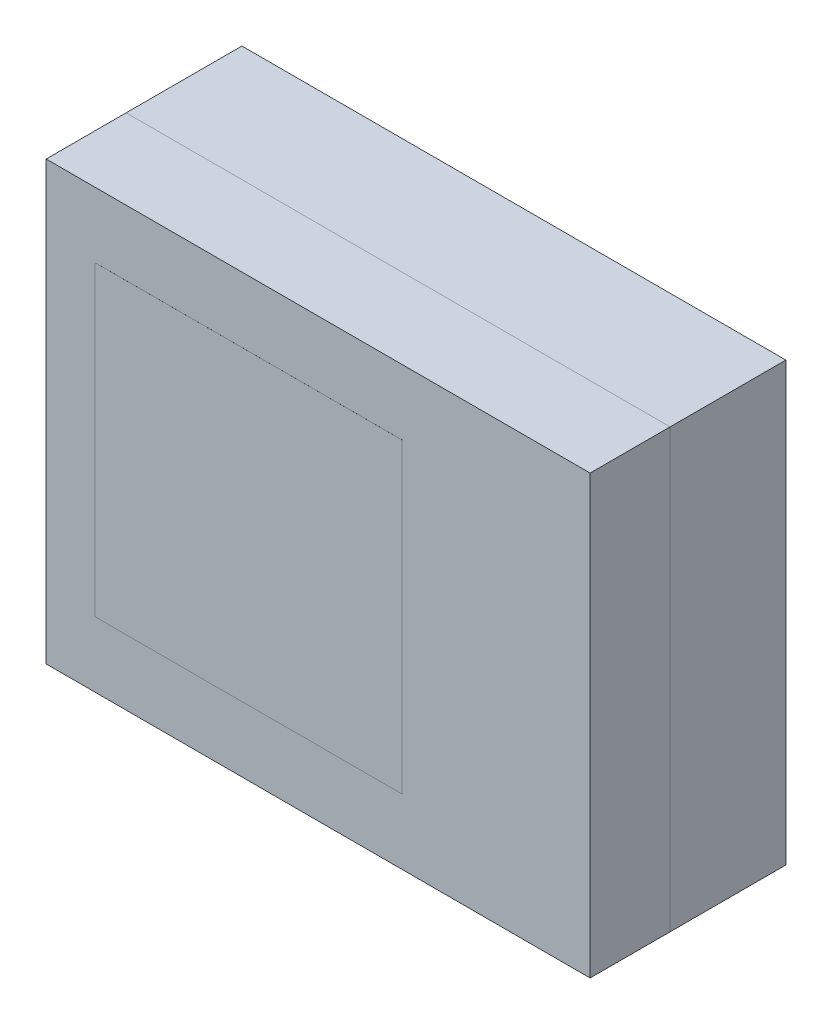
ISO-10303-21;
HEADER;
FILE_DESCRIPTION(('STEP AP214'),'2;1');
FILE_NAME('part.step','',(''),(''),'','','');
FILE_SCHEMA(('AUTOMOTIVE_DESIGN { 1 0 10303 214 1 1 1 1 }'));
ENDSEC;
DATA;
#1=APPLICATION_CONTEXT('core data for automotive mechanical design processes');
#2=APPLICATION_PROTOCOL_DEFINITION('international standard','automotive_design',2000,#1);
#3=PRODUCT_CONTEXT('',#1,'mechanical');
#4=PRODUCT('Part','Part','',(#3));
#5=PRODUCT_RELATED_PRODUCT_CATEGORY('part','',(#4));
#6=PRODUCT_DEFINITION_FORMATION('','',#4);
#7=PRODUCT_DEFINITION_CONTEXT('part definition',#1,'design');
#8=PRODUCT_DEFINITION('design','',#6,#7);
#9=PRODUCT_DEFINITION_SHAPE('','',#8);
#10=(LENGTH_UNIT() NAMED_UNIT(*) SI_UNIT(.MILLI.,.METRE.));
#11=(NAMED_UNIT(*) PLANE_ANGLE_UNIT() SI_UNIT($,.RADIAN.));
#12=(NAMED_UNIT(*) SI_UNIT($,.STERADIAN.) SOLID_ANGLE_UNIT());
#13=UNCERTAINTY_MEASURE_WITH_UNIT(LENGTH_MEASURE(1.E-05),#10,'distance_accuracy_value','');
#14=(GEOMETRIC_REPRESENTATION_CONTEXT(3) GLOBAL_UNCERTAINTY_ASSIGNED_CONTEXT((#13)) GLOBAL_UNIT_ASSIGNED_CONTEXT((#10,
#11,#12)) REPRESENTATION_CONTEXT('',''));
#15=CARTESIAN_POINT('',(0.,0.,0.));
#16=DIRECTION('',(0.,0.,1.));
#17=DIRECTION('',(1.,0.,0.));
#18=AXIS2_PLACEMENT_3D('',#15,#16,#17);
#19=CARTESIAN_POINT('',(0.,0.,-0.734));
#20=DIRECTION('',(0.,0.,-1.));
#21=DIRECTION('',(-1.,0.,0.));
#22=AXIS2_PLACEMENT_3D('',#19,#20,#21);
#23=PLANE('',#22);
#24=DIRECTION('',(0.,-1.,0.));
#25=VECTOR('',#24,1.);
#26=CARTESIAN_POINT('',(0.261,-0.125,-0.734));
#27=LINE('',#26,#25);
#28=CARTESIAN_POINT('',(0.261,-0.125,-0.734));
#29=VERTEX_POINT('',#28);
#30=CARTESIAN_POINT('',(0.261,-0.67,-0.734));
#31=VERTEX_POINT('',#30);
#32=EDGE_CURVE('E231',#29,#31,#27,.T.);
#33=ORIENTED_EDGE('',*,*,#32,.T.);
#34=DIRECTION('',(1.,0.,0.));
#35=VECTOR('',#34,1.);
#36=CARTESIAN_POINT('',(0.261,-0.67,-0.734));
#37=LINE('',#36,#35);
#38=CARTESIAN_POINT('',(1.131,-0.67,-0.734));
#39=VERTEX_POINT('',#38);
#40=EDGE_CURVE('E228',#31,#39,#37,.T.);
#41=ORIENTED_EDGE('',*,*,#40,.T.);
#42=DIRECTION('',(0.,-1.,0.));
#43=VECTOR('',#42,1.);
#44=CARTESIAN_POINT('',(1.131,-0.125,-0.734));
#45=LINE('',#44,#43);
#46=CARTESIAN_POINT('',(1.131,-0.125,-0.734));
#47=VERTEX_POINT('',#46);
#48=EDGE_CURVE('E223',#47,#39,#45,.T.);
#49=ORIENTED_EDGE('',*,*,#48,.F.);
#50=DIRECTION('',(1.,0.,0.));
#51=VECTOR('',#50,1.);
#52=CARTESIAN_POINT('',(0.261,-0.125,-0.734));
#53=LINE('',#52,#51);
#54=EDGE_CURVE('E219',#29,#47,#53,.T.);
#55=ORIENTED_EDGE('',*,*,#54,.F.);
#56=EDGE_LOOP('',(#33,#41,#49,#55));
#57=FACE_BOUND('',#56,.T.);
#58=DIRECTION('',(1.,0.,0.));
#59=VECTOR('',#58,1.);
#60=CARTESIAN_POINT('',(-0.609,-0.67,-0.734));
#61=LINE('',#60,#59);
#62=CARTESIAN_POINT('',(-0.609,-0.67,-0.734));
#63=VERTEX_POINT('',#62);
#64=CARTESIAN_POINT('',(-0.00900000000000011,-0.67,-0.734));
#65=VERTEX_POINT('',#64);
#66=EDGE_CURVE('E234',#63,#65,#61,.T.);
#67=ORIENTED_EDGE('',*,*,#66,.T.);
#68=DIRECTION('',(0.,1.,0.));
#69=VECTOR('',#68,1.);
#70=CARTESIAN_POINT('',(-0.00900000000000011,-0.67,-0.734));
#71=LINE('',#70,#69);
#72=CARTESIAN_POINT('',(-0.00900000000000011,0.67,-0.734));
#73=VERTEX_POINT('',#72);
#74=EDGE_CURVE('E265',#65,#73,#71,.T.);
#75=ORIENTED_EDGE('',*,*,#74,.T.);
#76=DIRECTION('',(1.,0.,0.));
#77=VECTOR('',#76,1.);
#78=CARTESIAN_POINT('',(-0.609,0.67,-0.734));
#79=LINE('',#78,#77);
#80=CARTESIAN_POINT('',(-0.609,0.67,-0.734));
#81=VERTEX_POINT('',#80);
#82=EDGE_CURVE('E268',#81,#73,#79,.T.);
#83=ORIENTED_EDGE('',*,*,#82,.F.);
#84=DIRECTION('',(0.,1.,0.));
#85=VECTOR('',#84,1.);
#86=CARTESIAN_POINT('',(-0.609,-0.67,-0.734));
#87=LINE('',#86,#85);
#88=EDGE_CURVE('E252',#63,#81,#87,.T.);
#89=ORIENTED_EDGE('',*,*,#88,.F.);
#90=EDGE_LOOP('',(#67,#75,#83,#89));
#91=FACE_BOUND('',#90,.T.);
#92=DIRECTION('',(0.,-1.,0.));
#93=VECTOR('',#92,1.);
#94=CARTESIAN_POINT('',(1.281,-0.82,-0.734));
#95=LINE('',#94,#93);
#96=CARTESIAN_POINT('',(1.281,0.82,-0.734));
#97=VERTEX_POINT('',#96);
#98=CARTESIAN_POINT('',(1.281,-0.82,-0.734));
#99=VERTEX_POINT('',#98);
#100=EDGE_CURVE('E291',#97,#99,#95,.T.);
#101=ORIENTED_EDGE('',*,*,#100,.T.);
#102=DIRECTION('',(-1.,0.,0.));
#103=VECTOR('',#102,1.);
#104=CARTESIAN_POINT('',(-0.759,-0.82,-0.734));
#105=LINE('',#104,#103);
#106=CARTESIAN_POINT('',(-0.759,-0.82,-0.734));
#107=VERTEX_POINT('',#106);
#108=EDGE_CURVE('E295',#99,#107,#105,.T.);
#109=ORIENTED_EDGE('',*,*,#108,.T.);
#110=DIRECTION('',(0.,1.,0.));
#111=VECTOR('',#110,1.);
#112=CARTESIAN_POINT('',(-0.759,-0.82,-0.734));
#113=LINE('',#112,#111);
#114=CARTESIAN_POINT('',(-0.759,0.82,-0.734));
#115=VERTEX_POINT('',#114);
#116=EDGE_CURVE('E299',#107,#115,#113,.T.);
#117=ORIENTED_EDGE('',*,*,#116,.T.);
#118=DIRECTION('',(1.,0.,0.));
#119=VECTOR('',#118,1.);
#120=CARTESIAN_POINT('',(-0.759,0.82,-0.734));
#121=LINE('',#120,#119);
#122=EDGE_CURVE('E302',#115,#97,#121,.T.);
#123=ORIENTED_EDGE('',*,*,#122,.T.);
#124=EDGE_LOOP('',(#101,#109,#117,#123));
#125=FACE_BOUND('',#124,.T.);
#126=DIRECTION('',(1.,0.,0.));
#127=VECTOR('',#126,1.);
#128=CARTESIAN_POINT('',(0.261,0.67,-0.734));
#129=LINE('',#128,#127);
#130=CARTESIAN_POINT('',(0.261,0.67,-0.734));
#131=VERTEX_POINT('',#130);
#132=CARTESIAN_POINT('',(1.131,0.67,-0.734));
#133=VERTEX_POINT('',#132);
#134=EDGE_CURVE('E66',#131,#133,#129,.T.);
#135=ORIENTED_EDGE('',*,*,#134,.F.);
#136=DIRECTION('',(0.,1.,0.));
#137=VECTOR('',#136,1.);
#138=CARTESIAN_POINT('',(0.261,0.125,-0.734));
#139=LINE('',#138,#137);
#140=CARTESIAN_POINT('',(0.261,0.125,-0.734));
#141=VERTEX_POINT('',#140);
#142=EDGE_CURVE('E161',#141,#131,#139,.T.);
#143=ORIENTED_EDGE('',*,*,#142,.F.);
#144=DIRECTION('',(1.,0.,0.));
#145=VECTOR('',#144,1.);
#146=CARTESIAN_POINT('',(0.261,0.125,-0.734));
#147=LINE('',#146,#145);
#148=CARTESIAN_POINT('',(1.131,0.125,-0.734));
#149=VERTEX_POINT('',#148);
#150=EDGE_CURVE('E164',#141,#149,#147,.T.);
#151=ORIENTED_EDGE('',*,*,#150,.T.);
#152=DIRECTION('',(0.,1.,0.));
#153=VECTOR('',#152,1.);
#154=CARTESIAN_POINT('',(1.131,0.125,-0.734));
#155=LINE('',#154,#153);
#156=EDGE_CURVE('E71',#149,#133,#155,.T.);
#157=ORIENTED_EDGE('',*,*,#156,.T.);
#158=EDGE_LOOP('',(#135,#143,#151,#157));
#159=FACE_BOUND('',#158,.T.);
#160=ADVANCED_FACE('F50',(#57,#91,#125,#159),#23,.T.);
#161=CARTESIAN_POINT('',(1.281,-0.82,-0.734));
#162=DIRECTION('',(-1.,0.,0.));
#163=DIRECTION('',(0.,0.,1.));
#164=AXIS2_PLACEMENT_3D('',#161,#162,#163);
#165=PLANE('',#164);
#166=DIRECTION('',(0.,-1.,0.));
#167=VECTOR('',#166,1.);
#168=CARTESIAN_POINT('',(1.281,-0.82,-0.3));
#169=LINE('',#168,#167);
#170=CARTESIAN_POINT('',(1.281,0.82,-0.3));
#171=VERTEX_POINT('',#170);
#172=CARTESIAN_POINT('',(1.281,-0.82,-0.3));
#173=VERTEX_POINT('',#172);
#174=EDGE_CURVE('E279',#171,#173,#169,.T.);
#175=ORIENTED_EDGE('',*,*,#174,.T.);
#176=DIRECTION('',(0.,0.,1.));
#177=VECTOR('',#176,1.);
#178=CARTESIAN_POINT('',(1.281,-0.82,-0.734));
#179=LINE('',#178,#177);
#180=EDGE_CURVE('E12',#99,#173,#179,.T.);
#181=ORIENTED_EDGE('',*,*,#180,.F.);
#182=ORIENTED_EDGE('',*,*,#100,.F.);
#183=DIRECTION('',(0.,0.,1.));
#184=VECTOR('',#183,1.);
#185=CARTESIAN_POINT('',(1.281,0.82,-0.734));
#186=LINE('',#185,#184);
#187=EDGE_CURVE('E305',#97,#171,#186,.T.);
#188=ORIENTED_EDGE('',*,*,#187,.T.);
#189=EDGE_LOOP('',(#175,#181,#182,#188));
#190=FACE_BOUND('',#189,.T.);
#191=ADVANCED_FACE('F52',(#190),#165,.F.);
#192=CARTESIAN_POINT('',(-0.759,-0.82,-0.734));
#193=DIRECTION('',(0.,1.,0.));
#194=DIRECTION('',(-1.,0.,0.));
#195=AXIS2_PLACEMENT_3D('',#192,#193,#194);
#196=PLANE('',#195);
#197=DIRECTION('',(-1.,0.,0.));
#198=VECTOR('',#197,1.);
#199=CARTESIAN_POINT('',(-0.759,-0.82,-0.3));
#200=LINE('',#199,#198);
#201=CARTESIAN_POINT('',(-0.759,-0.82,-0.3));
#202=VERTEX_POINT('',#201);
#203=EDGE_CURVE('E309',#173,#202,#200,.T.);
#204=ORIENTED_EDGE('',*,*,#203,.T.);
#205=DIRECTION('',(0.,0.,1.));
#206=VECTOR('',#205,1.);
#207=CARTESIAN_POINT('',(-0.759,-0.82,-0.734));
#208=LINE('',#207,#206);
#209=EDGE_CURVE('E59',#107,#202,#208,.T.);
#210=ORIENTED_EDGE('',*,*,#209,.F.);
#211=ORIENTED_EDGE('',*,*,#108,.F.);
#212=ORIENTED_EDGE('',*,*,#180,.T.);
#213=EDGE_LOOP('',(#204,#210,#211,#212));
#214=FACE_BOUND('',#213,.T.);
#215=ADVANCED_FACE('F344',(#214),#196,.F.);
#216=CARTESIAN_POINT('',(-0.759,-0.82,-0.734));
#217=DIRECTION('',(1.,0.,0.));
#218=DIRECTION('',(0.,0.,-1.));
#219=AXIS2_PLACEMENT_3D('',#216,#217,#218);
#220=PLANE('',#219);
#221=DIRECTION('',(0.,1.,0.));
#222=VECTOR('',#221,1.);
#223=CARTESIAN_POINT('',(-0.759,-0.82,-0.3));
#224=LINE('',#223,#222);
#225=CARTESIAN_POINT('',(-0.759,0.82,-0.3));
#226=VERTEX_POINT('',#225);
#227=EDGE_CURVE('E312',#202,#226,#224,.T.);
#228=ORIENTED_EDGE('',*,*,#227,.T.);
#229=DIRECTION('',(0.,0.,1.));
#230=VECTOR('',#229,1.);
#231=CARTESIAN_POINT('',(-0.759,0.82,-0.734));
#232=LINE('',#231,#230);
#233=EDGE_CURVE('E320',#115,#226,#232,.T.);
#234=ORIENTED_EDGE('',*,*,#233,.F.);
#235=ORIENTED_EDGE('',*,*,#116,.F.);
#236=ORIENTED_EDGE('',*,*,#209,.T.);
#237=EDGE_LOOP('',(#228,#234,#235,#236));
#238=FACE_BOUND('',#237,.T.);
#239=ADVANCED_FACE('F329',(#238),#220,.F.);
#240=CARTESIAN_POINT('',(-0.759,0.82,-0.734));
#241=DIRECTION('',(0.,-1.,0.));
#242=DIRECTION('',(0.,0.,-1.));
#243=AXIS2_PLACEMENT_3D('',#240,#241,#242);
#244=PLANE('',#243);
#245=DIRECTION('',(1.,0.,0.));
#246=VECTOR('',#245,1.);
#247=CARTESIAN_POINT('',(-0.759,0.82,-0.3));
#248=LINE('',#247,#246);
#249=EDGE_CURVE('E296',#226,#171,#248,.T.);
#250=ORIENTED_EDGE('',*,*,#249,.T.);
#251=ORIENTED_EDGE('',*,*,#187,.F.);
#252=ORIENTED_EDGE('',*,*,#122,.F.);
#253=ORIENTED_EDGE('',*,*,#233,.T.);
#254=EDGE_LOOP('',(#250,#251,#252,#253));
#255=FACE_BOUND('',#254,.T.);
#256=ADVANCED_FACE('F338',(#255),#244,.F.);
#257=CARTESIAN_POINT('',(0.,0.,-0.3));
#258=DIRECTION('',(0.,0.,-1.));
#259=DIRECTION('',(-1.,0.,0.));
#260=AXIS2_PLACEMENT_3D('',#257,#258,#259);
#261=PLANE('',#260);
#262=ORIENTED_EDGE('',*,*,#174,.F.);
#263=ORIENTED_EDGE('',*,*,#249,.F.);
#264=ORIENTED_EDGE('',*,*,#227,.F.);
#265=ORIENTED_EDGE('',*,*,#203,.F.);
#266=EDGE_LOOP('',(#262,#263,#264,#265));
#267=FACE_BOUND('',#266,.T.);
#268=ADVANCED_FACE('F335',(#267),#261,.F.);
#269=CARTESIAN_POINT('',(-0.609,-0.67,-0.79));
#270=DIRECTION('',(0.,-1.,0.));
#271=DIRECTION('',(1.,0.,0.));
#272=AXIS2_PLACEMENT_3D('',#269,#270,#271);
#273=PLANE('',#272);
#274=ORIENTED_EDGE('',*,*,#66,.F.);
#275=DIRECTION('',(0.,0.,1.));
#276=VECTOR('',#275,1.);
#277=CARTESIAN_POINT('',(-0.609,-0.67,-0.79));
#278=LINE('',#277,#276);
#279=CARTESIAN_POINT('',(-0.609,-0.67,-0.79));
#280=VERTEX_POINT('',#279);
#281=EDGE_CURVE('E275',#280,#63,#278,.T.);
#282=ORIENTED_EDGE('',*,*,#281,.F.);
#283=DIRECTION('',(1.,0.,0.));
#284=VECTOR('',#283,1.);
#285=CARTESIAN_POINT('',(-0.609,-0.67,-0.79));
#286=LINE('',#285,#284);
#287=CARTESIAN_POINT('',(-0.00900000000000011,-0.67,-0.79));
#288=VERTEX_POINT('',#287);
#289=EDGE_CURVE('E247',#280,#288,#286,.T.);
#290=ORIENTED_EDGE('',*,*,#289,.T.);
#291=DIRECTION('',(0.,0.,1.));
#292=VECTOR('',#291,1.);
#293=CARTESIAN_POINT('',(-0.00900000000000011,-0.67,-0.79));
#294=LINE('',#293,#292);
#295=EDGE_CURVE('E262',#288,#65,#294,.T.);
#296=ORIENTED_EDGE('',*,*,#295,.T.);
#297=EDGE_LOOP('',(#274,#282,#290,#296));
#298=FACE_BOUND('',#297,.T.);
#299=ADVANCED_FACE('F359',(#298),#273,.T.);
#300=CARTESIAN_POINT('',(-0.609,-0.67,-0.79));
#301=DIRECTION('',(1.,0.,0.));
#302=DIRECTION('',(0.,1.,0.));
#303=AXIS2_PLACEMENT_3D('',#300,#301,#302);
#304=PLANE('',#303);
#305=ORIENTED_EDGE('',*,*,#88,.T.);
#306=DIRECTION('',(0.,0.,1.));
#307=VECTOR('',#306,1.);
#308=CARTESIAN_POINT('',(-0.609,0.67,-0.79));
#309=LINE('',#308,#307);
#310=CARTESIAN_POINT('',(-0.609,0.67,-0.79));
#311=VERTEX_POINT('',#310);
#312=EDGE_CURVE('E280',#311,#81,#309,.T.);
#313=ORIENTED_EDGE('',*,*,#312,.F.);
#314=DIRECTION('',(0.,1.,0.));
#315=VECTOR('',#314,1.);
#316=CARTESIAN_POINT('',(-0.609,-0.67,-0.79));
#317=LINE('',#316,#315);
#318=EDGE_CURVE('E259',#280,#311,#317,.T.);
#319=ORIENTED_EDGE('',*,*,#318,.F.);
#320=ORIENTED_EDGE('',*,*,#281,.T.);
#321=EDGE_LOOP('',(#305,#313,#319,#320));
#322=FACE_BOUND('',#321,.T.);
#323=ADVANCED_FACE('F378',(#322),#304,.F.);
#324=CARTESIAN_POINT('',(-0.609,0.67,-0.79));
#325=DIRECTION('',(0.,-1.,0.));
#326=DIRECTION('',(0.,0.,-1.));
#327=AXIS2_PLACEMENT_3D('',#324,#325,#326);
#328=PLANE('',#327);
#329=ORIENTED_EDGE('',*,*,#82,.T.);
#330=DIRECTION('',(0.,0.,1.));
#331=VECTOR('',#330,1.);
#332=CARTESIAN_POINT('',(-0.00900000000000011,0.67,-0.79));
#333=LINE('',#332,#331);
#334=CARTESIAN_POINT('',(-0.00900000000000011,0.67,-0.79));
#335=VERTEX_POINT('',#334);
#336=EDGE_CURVE('E284',#335,#73,#333,.T.);
#337=ORIENTED_EDGE('',*,*,#336,.F.);
#338=DIRECTION('',(1.,0.,0.));
#339=VECTOR('',#338,1.);
#340=CARTESIAN_POINT('',(-0.609,0.67,-0.79));
#341=LINE('',#340,#339);
#342=EDGE_CURVE('E256',#311,#335,#341,.T.);
#343=ORIENTED_EDGE('',*,*,#342,.F.);
#344=ORIENTED_EDGE('',*,*,#312,.T.);
#345=EDGE_LOOP('',(#329,#337,#343,#344));
#346=FACE_BOUND('',#345,.T.);
#347=ADVANCED_FACE('F385',(#346),#328,.F.);
#348=CARTESIAN_POINT('',(-0.00900000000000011,-0.67,-0.79));
#349=DIRECTION('',(1.,0.,0.));
#350=DIRECTION('',(0.,0.,-1.));
#351=AXIS2_PLACEMENT_3D('',#348,#349,#350);
#352=PLANE('',#351);
#353=ORIENTED_EDGE('',*,*,#74,.F.);
#354=ORIENTED_EDGE('',*,*,#295,.F.);
#355=DIRECTION('',(0.,1.,0.));
#356=VECTOR('',#355,1.);
#357=CARTESIAN_POINT('',(-0.00900000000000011,-0.67,-0.79));
#358=LINE('',#357,#356);
#359=EDGE_CURVE('E251',#288,#335,#358,.T.);
#360=ORIENTED_EDGE('',*,*,#359,.T.);
#361=ORIENTED_EDGE('',*,*,#336,.T.);
#362=EDGE_LOOP('',(#353,#354,#360,#361));
#363=FACE_BOUND('',#362,.T.);
#364=ADVANCED_FACE('F393',(#363),#352,.T.);
#365=CARTESIAN_POINT('',(0.,0.,-0.79));
#366=DIRECTION('',(0.,0.,1.));
#367=DIRECTION('',(1.,0.,0.));
#368=AXIS2_PLACEMENT_3D('',#365,#366,#367);
#369=PLANE('',#368);
#370=ORIENTED_EDGE('',*,*,#289,.F.);
#371=ORIENTED_EDGE('',*,*,#318,.T.);
#372=ORIENTED_EDGE('',*,*,#342,.T.);
#373=ORIENTED_EDGE('',*,*,#359,.F.);
#374=EDGE_LOOP('',(#370,#371,#372,#373));
#375=FACE_BOUND('',#374,.T.);
#376=ADVANCED_FACE('F401',(#375),#369,.F.);
#377=CARTESIAN_POINT('',(0.261,-0.125,-0.79));
#378=DIRECTION('',(-1.,0.,0.));
#379=DIRECTION('',(0.,-1.,0.));
#380=AXIS2_PLACEMENT_3D('',#377,#378,#379);
#381=PLANE('',#380);
#382=ORIENTED_EDGE('',*,*,#32,.F.);
#383=DIRECTION('',(0.,0.,1.));
#384=VECTOR('',#383,1.);
#385=CARTESIAN_POINT('',(0.261,-0.125,-0.79));
#386=LINE('',#385,#384);
#387=CARTESIAN_POINT('',(0.261,-0.125,-0.79));
#388=VERTEX_POINT('',#387);
#389=EDGE_CURVE('E169',#388,#29,#386,.T.);
#390=ORIENTED_EDGE('',*,*,#389,.F.);
#391=DIRECTION('',(0.,-1.,0.));
#392=VECTOR('',#391,1.);
#393=CARTESIAN_POINT('',(0.261,-0.125,-0.79));
#394=LINE('',#393,#392);
#395=CARTESIAN_POINT('',(0.261,-0.67,-0.79));
#396=VERTEX_POINT('',#395);
#397=EDGE_CURVE('E224',#388,#396,#394,.T.);
#398=ORIENTED_EDGE('',*,*,#397,.T.);
#399=DIRECTION('',(0.,0.,1.));
#400=VECTOR('',#399,1.);
#401=CARTESIAN_POINT('',(0.261,-0.67,-0.79));
#402=LINE('',#401,#400);
#403=EDGE_CURVE('E203',#396,#31,#402,.T.);
#404=ORIENTED_EDGE('',*,*,#403,.T.);
#405=EDGE_LOOP('',(#382,#390,#398,#404));
#406=FACE_BOUND('',#405,.T.);
#407=ADVANCED_FACE('F408',(#406),#381,.T.);
#408=CARTESIAN_POINT('',(0.261,-0.125,-0.79));
#409=DIRECTION('',(0.,-1.,0.));
#410=DIRECTION('',(1.,0.,0.));
#411=AXIS2_PLACEMENT_3D('',#408,#409,#410);
#412=PLANE('',#411);
#413=ORIENTED_EDGE('',*,*,#54,.T.);
#414=DIRECTION('',(0.,0.,1.));
#415=VECTOR('',#414,1.);
#416=CARTESIAN_POINT('',(1.131,-0.125,-0.79));
#417=LINE('',#416,#415);
#418=CARTESIAN_POINT('',(1.131,-0.125,-0.79));
#419=VERTEX_POINT('',#418);
#420=EDGE_CURVE('E212',#419,#47,#417,.T.);
#421=ORIENTED_EDGE('',*,*,#420,.F.);
#422=DIRECTION('',(1.,0.,0.));
#423=VECTOR('',#422,1.);
#424=CARTESIAN_POINT('',(0.261,-0.125,-0.79));
#425=LINE('',#424,#423);
#426=EDGE_CURVE('E207',#388,#419,#425,.T.);
#427=ORIENTED_EDGE('',*,*,#426,.F.);
#428=ORIENTED_EDGE('',*,*,#389,.T.);
#429=EDGE_LOOP('',(#413,#421,#427,#428));
#430=FACE_BOUND('',#429,.T.);
#431=ADVANCED_FACE('F416',(#430),#412,.F.);
#432=CARTESIAN_POINT('',(1.131,-0.125,-0.79));
#433=DIRECTION('',(-1.,0.,0.));
#434=DIRECTION('',(0.,-1.,0.));
#435=AXIS2_PLACEMENT_3D('',#432,#433,#434);
#436=PLANE('',#435);
#437=ORIENTED_EDGE('',*,*,#48,.T.);
#438=DIRECTION('',(0.,0.,1.));
#439=VECTOR('',#438,1.);
#440=CARTESIAN_POINT('',(1.131,-0.67,-0.79));
#441=LINE('',#440,#439);
#442=CARTESIAN_POINT('',(1.131,-0.67,-0.79));
#443=VERTEX_POINT('',#442);
#444=EDGE_CURVE('E208',#443,#39,#441,.T.);
#445=ORIENTED_EDGE('',*,*,#444,.F.);
#446=DIRECTION('',(0.,-1.,0.));
#447=VECTOR('',#446,1.);
#448=CARTESIAN_POINT('',(1.131,-0.125,-0.79));
#449=LINE('',#448,#447);
#450=EDGE_CURVE('E237',#419,#443,#449,.T.);
#451=ORIENTED_EDGE('',*,*,#450,.F.);
#452=ORIENTED_EDGE('',*,*,#420,.T.);
#453=EDGE_LOOP('',(#437,#445,#451,#452));
#454=FACE_BOUND('',#453,.T.);
#455=ADVANCED_FACE('F424',(#454),#436,.F.);
#456=CARTESIAN_POINT('',(0.261,-0.67,-0.79));
#457=DIRECTION('',(0.,-1.,0.));
#458=DIRECTION('',(1.,0.,0.));
#459=AXIS2_PLACEMENT_3D('',#456,#457,#458);
#460=PLANE('',#459);
#461=ORIENTED_EDGE('',*,*,#40,.F.);
#462=ORIENTED_EDGE('',*,*,#403,.F.);
#463=DIRECTION('',(1.,0.,0.));
#464=VECTOR('',#463,1.);
#465=CARTESIAN_POINT('',(0.261,-0.67,-0.79));
#466=LINE('',#465,#464);
#467=EDGE_CURVE('E240',#396,#443,#466,.T.);
#468=ORIENTED_EDGE('',*,*,#467,.T.);
#469=ORIENTED_EDGE('',*,*,#444,.T.);
#470=EDGE_LOOP('',(#461,#462,#468,#469));
#471=FACE_BOUND('',#470,.T.);
#472=ADVANCED_FACE('F432',(#471),#460,.T.);
#473=CARTESIAN_POINT('',(0.,0.,-0.79));
#474=DIRECTION('',(0.,0.,1.));
#475=DIRECTION('',(1.,0.,0.));
#476=AXIS2_PLACEMENT_3D('',#473,#474,#475);
#477=PLANE('',#476);
#478=ORIENTED_EDGE('',*,*,#397,.F.);
#479=ORIENTED_EDGE('',*,*,#426,.T.);
#480=ORIENTED_EDGE('',*,*,#450,.T.);
#481=ORIENTED_EDGE('',*,*,#467,.F.);
#482=EDGE_LOOP('',(#478,#479,#480,#481));
#483=FACE_BOUND('',#482,.T.);
#484=ADVANCED_FACE('F440',(#483),#477,.F.);
#485=CARTESIAN_POINT('',(0.261,0.125,-0.79));
#486=DIRECTION('',(1.,0.,0.));
#487=DIRECTION('',(0.,1.,0.));
#488=AXIS2_PLACEMENT_3D('',#485,#486,#487);
#489=PLANE('',#488);
#490=ORIENTED_EDGE('',*,*,#142,.T.);
#491=DIRECTION('',(0.,0.,1.));
#492=VECTOR('',#491,1.);
#493=CARTESIAN_POINT('',(0.261,0.67,-0.79));
#494=LINE('',#493,#492);
#495=CARTESIAN_POINT('',(0.261,0.67,-0.79));
#496=VERTEX_POINT('',#495);
#497=EDGE_CURVE('E541',#496,#131,#494,.T.);
#498=ORIENTED_EDGE('',*,*,#497,.F.);
#499=DIRECTION('',(0.,1.,0.));
#500=VECTOR('',#499,1.);
#501=CARTESIAN_POINT('',(0.261,0.125,-0.79));
#502=LINE('',#501,#500);
#503=CARTESIAN_POINT('',(0.261,0.125,-0.79));
#504=VERTEX_POINT('',#503);
#505=EDGE_CURVE('E175',#504,#496,#502,.T.);
#506=ORIENTED_EDGE('',*,*,#505,.F.);
#507=DIRECTION('',(0.,0.,1.));
#508=VECTOR('',#507,1.);
#509=CARTESIAN_POINT('',(0.261,0.125,-0.79));
#510=LINE('',#509,#508);
#511=EDGE_CURVE('E172',#504,#141,#510,.T.);
#512=ORIENTED_EDGE('',*,*,#511,.T.);
#513=EDGE_LOOP('',(#490,#498,#506,#512));
#514=FACE_BOUND('',#513,.T.);
#515=ADVANCED_FACE('F173',(#514),#489,.F.);
#516=CARTESIAN_POINT('',(0.261,0.67,-0.79));
#517=DIRECTION('',(0.,-1.,0.));
#518=DIRECTION('',(1.,0.,0.));
#519=AXIS2_PLACEMENT_3D('',#516,#517,#518);
#520=PLANE('',#519);
#521=ORIENTED_EDGE('',*,*,#134,.T.);
#522=DIRECTION('',(0.,0.,1.));
#523=VECTOR('',#522,1.);
#524=CARTESIAN_POINT('',(1.131,0.67,-0.79));
#525=LINE('',#524,#523);
#526=CARTESIAN_POINT('',(1.131,0.67,-0.79));
#527=VERTEX_POINT('',#526);
#528=EDGE_CURVE('E543',#527,#133,#525,.T.);
#529=ORIENTED_EDGE('',*,*,#528,.F.);
#530=DIRECTION('',(1.,0.,0.));
#531=VECTOR('',#530,1.);
#532=CARTESIAN_POINT('',(0.261,0.67,-0.79));
#533=LINE('',#532,#531);
#534=EDGE_CURVE('E189',#496,#527,#533,.T.);
#535=ORIENTED_EDGE('',*,*,#534,.F.);
#536=ORIENTED_EDGE('',*,*,#497,.T.);
#537=EDGE_LOOP('',(#521,#529,#535,#536));
#538=FACE_BOUND('',#537,.T.);
#539=ADVANCED_FACE('F455',(#538),#520,.F.);
#540=CARTESIAN_POINT('',(1.131,0.125,-0.79));
#541=DIRECTION('',(1.,0.,0.));
#542=DIRECTION('',(0.,1.,0.));
#543=AXIS2_PLACEMENT_3D('',#540,#541,#542);
#544=PLANE('',#543);
#545=ORIENTED_EDGE('',*,*,#156,.F.);
#546=DIRECTION('',(0.,0.,1.));
#547=VECTOR('',#546,1.);
#548=CARTESIAN_POINT('',(1.131,0.125,-0.79));
#549=LINE('',#548,#547);
#550=CARTESIAN_POINT('',(1.131,0.125,-0.79));
#551=VERTEX_POINT('',#550);
#552=EDGE_CURVE('E181',#551,#149,#549,.T.);
#553=ORIENTED_EDGE('',*,*,#552,.F.);
#554=DIRECTION('',(0.,1.,0.));
#555=VECTOR('',#554,1.);
#556=CARTESIAN_POINT('',(1.131,0.125,-0.79));
#557=LINE('',#556,#555);
#558=EDGE_CURVE('E197',#551,#527,#557,.T.);
#559=ORIENTED_EDGE('',*,*,#558,.T.);
#560=ORIENTED_EDGE('',*,*,#528,.T.);
#561=EDGE_LOOP('',(#545,#553,#559,#560));
#562=FACE_BOUND('',#561,.T.);
#563=ADVANCED_FACE('F462',(#562),#544,.T.);
#564=CARTESIAN_POINT('',(0.261,0.125,-0.79));
#565=DIRECTION('',(0.,-1.,0.));
#566=DIRECTION('',(1.,0.,0.));
#567=AXIS2_PLACEMENT_3D('',#564,#565,#566);
#568=PLANE('',#567);
#569=ORIENTED_EDGE('',*,*,#150,.F.);
#570=ORIENTED_EDGE('',*,*,#511,.F.);
#571=DIRECTION('',(1.,0.,0.));
#572=VECTOR('',#571,1.);
#573=CARTESIAN_POINT('',(0.261,0.125,-0.79));
#574=LINE('',#573,#572);
#575=EDGE_CURVE('E180',#504,#551,#574,.T.);
#576=ORIENTED_EDGE('',*,*,#575,.T.);
#577=ORIENTED_EDGE('',*,*,#552,.T.);
#578=EDGE_LOOP('',(#569,#570,#576,#577));
#579=FACE_BOUND('',#578,.T.);
#580=ADVANCED_FACE('F183',(#579),#568,.T.);
#581=CARTESIAN_POINT('',(0.,0.,-0.79));
#582=DIRECTION('',(0.,0.,-1.));
#583=DIRECTION('',(-1.,0.,0.));
#584=AXIS2_PLACEMENT_3D('',#581,#582,#583);
#585=PLANE('',#584);
#586=ORIENTED_EDGE('',*,*,#505,.T.);
#587=ORIENTED_EDGE('',*,*,#534,.T.);
#588=ORIENTED_EDGE('',*,*,#558,.F.);
#589=ORIENTED_EDGE('',*,*,#575,.F.);
#590=EDGE_LOOP('',(#586,#587,#588,#589));
#591=FACE_BOUND('',#590,.T.);
#592=ADVANCED_FACE('F477',(#591),#585,.T.);
#593=CLOSED_SHELL('',(#160,#191,#215,#239,#256,#268,#299,#323,#347,#364,#376,#407,#431,#455,
#472,#484,#515,#539,#563,#580,#592));
#594=MANIFOLD_SOLID_BREP('B2',#593);
#595=CARTESIAN_POINT('',(1.281,-0.82,-0.3));
#596=DIRECTION('',(-1.,0.,0.));
#597=DIRECTION('',(0.,0.,1.));
#598=AXIS2_PLACEMENT_3D('',#595,#596,#597);
#599=PLANE('',#598);
#600=DIRECTION('',(0.,-1.,0.));
#601=VECTOR('',#600,1.);
#602=CARTESIAN_POINT('',(1.281,-0.82,0.));
#603=LINE('',#602,#601);
#604=CARTESIAN_POINT('',(1.281,0.82,0.));
#605=VERTEX_POINT('',#604);
#606=CARTESIAN_POINT('',(1.281,-0.82,0.));
#607=VERTEX_POINT('',#606);
#608=EDGE_CURVE('E639',#605,#607,#603,.T.);
#609=ORIENTED_EDGE('',*,*,#608,.T.);
#610=DIRECTION('',(0.,0.,1.));
#611=VECTOR('',#610,1.);
#612=CARTESIAN_POINT('',(1.281,-0.82,-0.3));
#613=LINE('',#612,#611);
#614=CARTESIAN_POINT('',(1.281,-0.82,-0.3));
#615=VERTEX_POINT('',#614);
#616=EDGE_CURVE('E48',#615,#607,#613,.T.);
#617=ORIENTED_EDGE('',*,*,#616,.F.);
#618=DIRECTION('',(0.,-1.,0.));
#619=VECTOR('',#618,1.);
#620=CARTESIAN_POINT('',(1.281,-0.82,-0.3));
#621=LINE('',#620,#619);
#622=CARTESIAN_POINT('',(1.281,0.82,-0.3));
#623=VERTEX_POINT('',#622);
#624=EDGE_CURVE('E627',#623,#615,#621,.T.);
#625=ORIENTED_EDGE('',*,*,#624,.F.);
#626=DIRECTION('',(0.,0.,1.));
#627=VECTOR('',#626,1.);
#628=CARTESIAN_POINT('',(1.281,0.82,-0.3));
#629=LINE('',#628,#627);
#630=EDGE_CURVE('E635',#623,#605,#629,.T.);
#631=ORIENTED_EDGE('',*,*,#630,.T.);
#632=EDGE_LOOP('',(#609,#617,#625,#631));
#633=FACE_BOUND('',#632,.T.);
#634=ADVANCED_FACE('F576',(#633),#599,.F.);
#635=CARTESIAN_POINT('',(-0.759,-0.82,-0.3));
#636=DIRECTION('',(0.,1.,0.));
#637=DIRECTION('',(-1.,0.,0.));
#638=AXIS2_PLACEMENT_3D('',#635,#636,#637);
#639=PLANE('',#638);
#640=DIRECTION('',(-1.,0.,0.));
#641=VECTOR('',#640,1.);
#642=CARTESIAN_POINT('',(-0.759,-0.82,0.));
#643=LINE('',#642,#641);
#644=CARTESIAN_POINT('',(-0.759,-0.82,0.));
#645=VERTEX_POINT('',#644);
#646=EDGE_CURVE('E631',#607,#645,#643,.T.);
#647=ORIENTED_EDGE('',*,*,#646,.T.);
#648=DIRECTION('',(0.,0.,1.));
#649=VECTOR('',#648,1.);
#650=CARTESIAN_POINT('',(-0.759,-0.82,-0.3));
#651=LINE('',#650,#649);
#652=CARTESIAN_POINT('',(-0.759,-0.82,-0.3));
#653=VERTEX_POINT('',#652);
#654=EDGE_CURVE('E584',#653,#645,#651,.T.);
#655=ORIENTED_EDGE('',*,*,#654,.F.);
#656=DIRECTION('',(-1.,0.,0.));
#657=VECTOR('',#656,1.);
#658=CARTESIAN_POINT('',(-0.759,-0.82,-0.3));
#659=LINE('',#658,#657);
#660=EDGE_CURVE('E622',#615,#653,#659,.T.);
#661=ORIENTED_EDGE('',*,*,#660,.F.);
#662=ORIENTED_EDGE('',*,*,#616,.T.);
#663=EDGE_LOOP('',(#647,#655,#661,#662));
#664=FACE_BOUND('',#663,.T.);
#665=ADVANCED_FACE('F630',(#664),#639,.F.);
#666=CARTESIAN_POINT('',(-0.759,-0.82,-0.3));
#667=DIRECTION('',(1.,0.,0.));
#668=DIRECTION('',(0.,0.,-1.));
#669=AXIS2_PLACEMENT_3D('',#666,#667,#668);
#670=PLANE('',#669);
#671=DIRECTION('',(0.,1.,0.));
#672=VECTOR('',#671,1.);
#673=CARTESIAN_POINT('',(-0.759,-0.82,0.));
#674=LINE('',#673,#672);
#675=CARTESIAN_POINT('',(-0.759,0.82,0.));
#676=VERTEX_POINT('',#675);
#677=EDGE_CURVE('E609',#645,#676,#674,.T.);
#678=ORIENTED_EDGE('',*,*,#677,.T.);
#679=DIRECTION('',(0.,0.,1.));
#680=VECTOR('',#679,1.);
#681=CARTESIAN_POINT('',(-0.759,0.82,-0.3));
#682=LINE('',#681,#680);
#683=CARTESIAN_POINT('',(-0.759,0.82,-0.3));
#684=VERTEX_POINT('',#683);
#685=EDGE_CURVE('E632',#684,#676,#682,.T.);
#686=ORIENTED_EDGE('',*,*,#685,.F.);
#687=DIRECTION('',(0.,1.,0.));
#688=VECTOR('',#687,1.);
#689=CARTESIAN_POINT('',(-0.759,-0.82,-0.3));
#690=LINE('',#689,#688);
#691=EDGE_CURVE('E625',#653,#684,#690,.T.);
#692=ORIENTED_EDGE('',*,*,#691,.F.);
#693=ORIENTED_EDGE('',*,*,#654,.T.);
#694=EDGE_LOOP('',(#678,#686,#692,#693));
#695=FACE_BOUND('',#694,.T.);
#696=ADVANCED_FACE('F633',(#695),#670,.F.);
#697=CARTESIAN_POINT('',(-0.759,0.82,-0.3));
#698=DIRECTION('',(0.,-1.,0.));
#699=DIRECTION('',(1.,0.,0.));
#700=AXIS2_PLACEMENT_3D('',#697,#698,#699);
#701=PLANE('',#700);
#702=DIRECTION('',(1.,0.,0.));
#703=VECTOR('',#702,1.);
#704=CARTESIAN_POINT('',(-0.759,0.82,0.));
#705=LINE('',#704,#703);
#706=EDGE_CURVE('E615',#676,#605,#705,.T.);
#707=ORIENTED_EDGE('',*,*,#706,.T.);
#708=ORIENTED_EDGE('',*,*,#630,.F.);
#709=DIRECTION('',(1.,0.,0.));
#710=VECTOR('',#709,1.);
#711=CARTESIAN_POINT('',(-0.759,0.82,-0.3));
#712=LINE('',#711,#710);
#713=EDGE_CURVE('E592',#684,#623,#712,.T.);
#714=ORIENTED_EDGE('',*,*,#713,.F.);
#715=ORIENTED_EDGE('',*,*,#685,.T.);
#716=EDGE_LOOP('',(#707,#708,#714,#715));
#717=FACE_BOUND('',#716,.T.);
#718=ADVANCED_FACE('F646',(#717),#701,.F.);
#719=CARTESIAN_POINT('',(0.,0.,-0.3));
#720=DIRECTION('',(0.,0.,-1.));
#721=DIRECTION('',(-1.,0.,0.));
#722=AXIS2_PLACEMENT_3D('',#719,#720,#721);
#723=PLANE('',#722);
#724=ORIENTED_EDGE('',*,*,#624,.T.);
#725=ORIENTED_EDGE('',*,*,#660,.T.);
#726=ORIENTED_EDGE('',*,*,#691,.T.);
#727=ORIENTED_EDGE('',*,*,#713,.T.);
#728=EDGE_LOOP('',(#724,#725,#726,#727));
#729=FACE_BOUND('',#728,.T.);
#730=ADVANCED_FACE('F623',(#729),#723,.T.);
#731=CARTESIAN_POINT('',(0.,0.,0.));
#732=DIRECTION('',(0.,0.,-1.));
#733=DIRECTION('',(-1.,0.,0.));
#734=AXIS2_PLACEMENT_3D('',#731,#732,#733);
#735=PLANE('',#734);
#736=ORIENTED_EDGE('',*,*,#608,.F.);
#737=ORIENTED_EDGE('',*,*,#706,.F.);
#738=ORIENTED_EDGE('',*,*,#677,.F.);
#739=ORIENTED_EDGE('',*,*,#646,.F.);
#740=EDGE_LOOP('',(#736,#737,#738,#739));
#741=FACE_BOUND('',#740,.T.);
#742=ADVANCED_FACE('F649',(#741),#735,.F.);
#743=CLOSED_SHELL('',(#634,#665,#696,#718,#730,#742));
#744=MANIFOLD_SOLID_BREP('B6',#743);
#745=CARTESIAN_POINT('',(0.575,-0.575,0.0001));
#746=DIRECTION('',(-1.,0.,0.));
#747=DIRECTION('',(0.,0.,1.));
#748=AXIS2_PLACEMENT_3D('',#745,#746,#747);
#749=PLANE('',#748);
#750=DIRECTION('',(0.,1.,0.));
#751=VECTOR('',#750,1.);
#752=CARTESIAN_POINT('',(0.575,-0.575,0.));
#753=LINE('',#752,#751);
#754=CARTESIAN_POINT('',(0.575,-0.575,0.));
#755=VERTEX_POINT('',#754);
#756=CARTESIAN_POINT('',(0.575,0.575,0.));
#757=VERTEX_POINT('',#756);
#758=EDGE_CURVE('E763',#755,#757,#753,.T.);
#759=ORIENTED_EDGE('',*,*,#758,.T.);
#760=DIRECTION('',(0.,0.,-1.));
#761=VECTOR('',#760,1.);
#762=CARTESIAN_POINT('',(0.575,0.575,0.0001));
#763=LINE('',#762,#761);
#764=CARTESIAN_POINT('',(0.575,0.575,0.0001));
#765=VERTEX_POINT('',#764);
#766=EDGE_CURVE('E574',#765,#757,#763,.T.);
#767=ORIENTED_EDGE('',*,*,#766,.F.);
#768=DIRECTION('',(0.,1.,0.));
#769=VECTOR('',#768,1.);
#770=CARTESIAN_POINT('',(0.575,-0.575,0.0001));
#771=LINE('',#770,#769);
#772=CARTESIAN_POINT('',(0.575,-0.575,0.0001));
#773=VERTEX_POINT('',#772);
#774=EDGE_CURVE('E751',#773,#765,#771,.T.);
#775=ORIENTED_EDGE('',*,*,#774,.F.);
#776=DIRECTION('',(0.,0.,-1.));
#777=VECTOR('',#776,1.);
#778=CARTESIAN_POINT('',(0.575,-0.575,0.0001));
#779=LINE('',#778,#777);
#780=EDGE_CURVE('E759',#773,#755,#779,.T.);
#781=ORIENTED_EDGE('',*,*,#780,.T.);
#782=EDGE_LOOP('',(#759,#767,#775,#781));
#783=FACE_BOUND('',#782,.T.);
#784=ADVANCED_FACE('F700',(#783),#749,.F.);
#785=CARTESIAN_POINT('',(-0.575,0.575,0.0001));
#786=DIRECTION('',(0.,-1.,0.));
#787=DIRECTION('',(0.,0.,-1.));
#788=AXIS2_PLACEMENT_3D('',#785,#786,#787);
#789=PLANE('',#788);
#790=DIRECTION('',(-1.,0.,0.));
#791=VECTOR('',#790,1.);
#792=CARTESIAN_POINT('',(-0.575,0.575,0.));
#793=LINE('',#792,#791);
#794=CARTESIAN_POINT('',(-0.575,0.575,0.));
#795=VERTEX_POINT('',#794);
#796=EDGE_CURVE('E755',#757,#795,#793,.T.);
#797=ORIENTED_EDGE('',*,*,#796,.T.);
#798=DIRECTION('',(0.,0.,-1.));
#799=VECTOR('',#798,1.);
#800=CARTESIAN_POINT('',(-0.575,0.575,0.0001));
#801=LINE('',#800,#799);
#802=CARTESIAN_POINT('',(-0.575,0.575,0.0001));
#803=VERTEX_POINT('',#802);
#804=EDGE_CURVE('E708',#803,#795,#801,.T.);
#805=ORIENTED_EDGE('',*,*,#804,.F.);
#806=DIRECTION('',(-1.,0.,0.));
#807=VECTOR('',#806,1.);
#808=CARTESIAN_POINT('',(-0.575,0.575,0.0001));
#809=LINE('',#808,#807);
#810=EDGE_CURVE('E746',#765,#803,#809,.T.);
#811=ORIENTED_EDGE('',*,*,#810,.F.);
#812=ORIENTED_EDGE('',*,*,#766,.T.);
#813=EDGE_LOOP('',(#797,#805,#811,#812));
#814=FACE_BOUND('',#813,.T.);
#815=ADVANCED_FACE('F754',(#814),#789,.F.);
#816=CARTESIAN_POINT('',(-0.575,-0.575,0.0001));
#817=DIRECTION('',(1.,0.,0.));
#818=DIRECTION('',(0.,0.,-1.));
#819=AXIS2_PLACEMENT_3D('',#816,#817,#818);
#820=PLANE('',#819);
#821=DIRECTION('',(0.,-1.,0.));
#822=VECTOR('',#821,1.);
#823=CARTESIAN_POINT('',(-0.575,-0.575,0.));
#824=LINE('',#823,#822);
#825=CARTESIAN_POINT('',(-0.575,-0.575,0.));
#826=VERTEX_POINT('',#825);
#827=EDGE_CURVE('E733',#795,#826,#824,.T.);
#828=ORIENTED_EDGE('',*,*,#827,.T.);
#829=DIRECTION('',(0.,0.,-1.));
#830=VECTOR('',#829,1.);
#831=CARTESIAN_POINT('',(-0.575,-0.575,0.0001));
#832=LINE('',#831,#830);
#833=CARTESIAN_POINT('',(-0.575,-0.575,0.0001));
#834=VERTEX_POINT('',#833);
#835=EDGE_CURVE('E756',#834,#826,#832,.T.);
#836=ORIENTED_EDGE('',*,*,#835,.F.);
#837=DIRECTION('',(0.,-1.,0.));
#838=VECTOR('',#837,1.);
#839=CARTESIAN_POINT('',(-0.575,-0.575,0.0001));
#840=LINE('',#839,#838);
#841=EDGE_CURVE('E749',#803,#834,#840,.T.);
#842=ORIENTED_EDGE('',*,*,#841,.F.);
#843=ORIENTED_EDGE('',*,*,#804,.T.);
#844=EDGE_LOOP('',(#828,#836,#842,#843));
#845=FACE_BOUND('',#844,.T.);
#846=ADVANCED_FACE('F757',(#845),#820,.F.);
#847=CARTESIAN_POINT('',(-0.575,-0.575,0.0001));
#848=DIRECTION('',(0.,1.,0.));
#849=DIRECTION('',(0.,0.,1.));
#850=AXIS2_PLACEMENT_3D('',#847,#848,#849);
#851=PLANE('',#850);
#852=DIRECTION('',(1.,0.,0.));
#853=VECTOR('',#852,1.);
#854=CARTESIAN_POINT('',(-0.575,-0.575,0.));
#855=LINE('',#854,#853);
#856=EDGE_CURVE('E739',#826,#755,#855,.T.);
#857=ORIENTED_EDGE('',*,*,#856,.T.);
#858=ORIENTED_EDGE('',*,*,#780,.F.);
#859=DIRECTION('',(1.,0.,0.));
#860=VECTOR('',#859,1.);
#861=CARTESIAN_POINT('',(-0.575,-0.575,0.0001));
#862=LINE('',#861,#860);
#863=EDGE_CURVE('E716',#834,#773,#862,.T.);
#864=ORIENTED_EDGE('',*,*,#863,.F.);
#865=ORIENTED_EDGE('',*,*,#835,.T.);
#866=EDGE_LOOP('',(#857,#858,#864,#865));
#867=FACE_BOUND('',#866,.T.);
#868=ADVANCED_FACE('F770',(#867),#851,.F.);
#869=CARTESIAN_POINT('',(0.,0.,0.0001));
#870=DIRECTION('',(0.,0.,-1.));
#871=DIRECTION('',(-1.,0.,0.));
#872=AXIS2_PLACEMENT_3D('',#869,#870,#871);
#873=PLANE('',#872);
#874=ORIENTED_EDGE('',*,*,#774,.T.);
#875=ORIENTED_EDGE('',*,*,#810,.T.);
#876=ORIENTED_EDGE('',*,*,#841,.T.);
#877=ORIENTED_EDGE('',*,*,#863,.T.);
#878=EDGE_LOOP('',(#874,#875,#876,#877));
#879=FACE_BOUND('',#878,.T.);
#880=ADVANCED_FACE('F747',(#879),#873,.F.);
#881=CARTESIAN_POINT('',(0.,0.,0.));
#882=DIRECTION('',(0.,0.,-1.));
#883=DIRECTION('',(-1.,0.,0.));
#884=AXIS2_PLACEMENT_3D('',#881,#882,#883);
#885=PLANE('',#884);
#886=ORIENTED_EDGE('',*,*,#758,.F.);
#887=ORIENTED_EDGE('',*,*,#856,.F.);
#888=ORIENTED_EDGE('',*,*,#827,.F.);
#889=ORIENTED_EDGE('',*,*,#796,.F.);
#890=EDGE_LOOP('',(#886,#887,#888,#889));
#891=FACE_BOUND('',#890,.T.);
#892=ADVANCED_FACE('F773',(#891),#885,.T.);
#893=CLOSED_SHELL('',(#784,#815,#846,#868,#880,#892));
#894=MANIFOLD_SOLID_BREP('B42',#893);
#895=ADVANCED_BREP_SHAPE_REPRESENTATION('',(#18,#594,#744,#894),#14);
#896=SHAPE_DEFINITION_REPRESENTATION(#9,#895);
ENDSEC;
END-ISO-10303-21;
